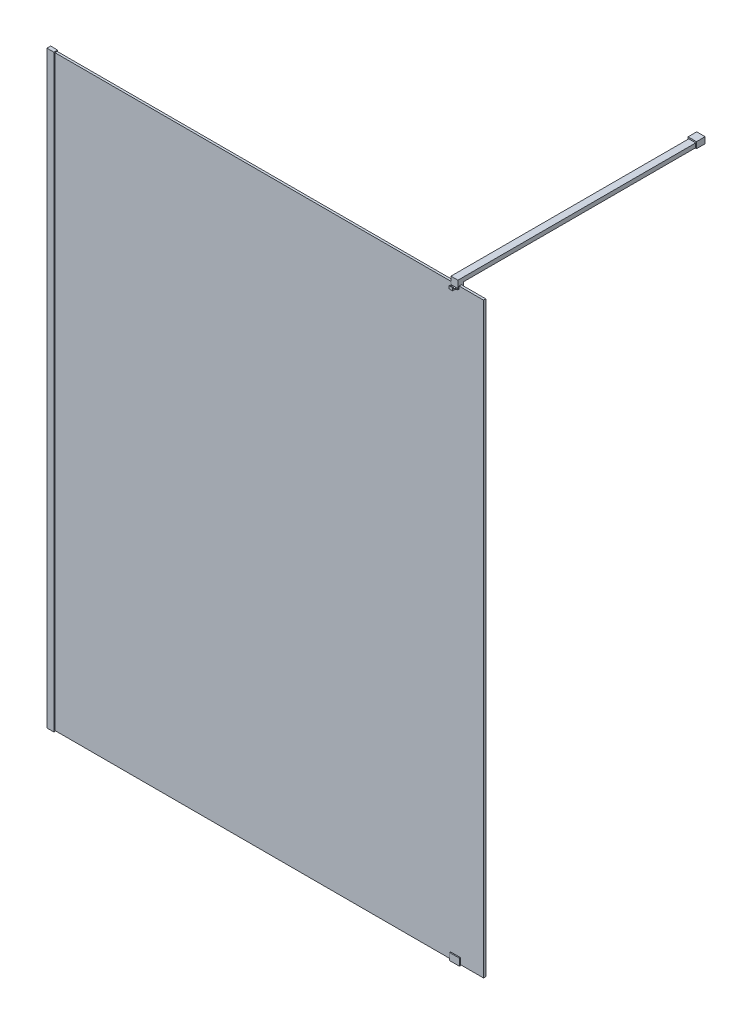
from build123d import *

# Parameters (mm, degrees)
DODANIE_WYCI_GNI_CIE1_DEPTH     = 2100
SZKIC2_W                        = 1547
SZKIC2_H                        = 8
DODANIE_WYCI_GNI_CIE2_DEPTH     = 2100
SZKIC4_W                        = 25
SZKIC4_H                        = 13.3
DODANIE_WYCI_GNI_CIE3_DEPTH     = 3
SZKIC5_W                        = 25
SZKIC5_H                        = 13.3
DODANIE_WYCI_GNI_CIE4_DEPTH     = 3
DODANIE_WYCI_GNI_CIE5_DEPTH     = 17.5
DODANIE_WYCI_GNI_CIE6_DEPTH     = 12.5
WYTNIJ_WYCI_GNI_CIE1_DEPTH      = 2618.585101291
WYTNIJ_WYCI_GNI_CIE1_DEPTH_BACK = 2618.585101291
SZKIC10_W                       = 25
SZKIC10_H                       = 861.63
DODANIE_WYCI_GNI_CIE7_DEPTH     = 15
SZKIC14_W                       = 30
SZKIC14_H                       = 22
DODANIE_WYCI_GNI_CIE8_DEPTH     = 31


with BuildPart() as part:
    # Szkic1 → Dodanie-wyci_gni_cie1 (new body)
    with BuildSketch(Plane(origin=(0, 0, 0), x_dir=(1, 0, 0), z_dir=(0, 1, 0))):
        Polygon((0, 0), (0, 13.3), (25, 13.3), (25, 11.4), (11.45, 11.4), (11.45, 3.4), (25, 3.4), (25, 0), align=None)
    extrude(amount=DODANIE_WYCI_GNI_CIE1_DEPTH)

    # Szkic4 → Dodanie-wyci_gni_cie3 (add)
    with BuildSketch(Plane(origin=(0, 2100, 0), x_dir=(1, 0, 0), z_dir=(0, 1, 0))):
        with Locations((12.5, 6.65)):
            Rectangle(SZKIC4_W, SZKIC4_H)
    extrude(amount=DODANIE_WYCI_GNI_CIE3_DEPTH)

    # Szkic5 → Dodanie-wyci_gni_cie4 (add)
    with BuildSketch(Plane.XZ):
        with Locations((12.5, -6.65)):
            Rectangle(SZKIC5_W, SZKIC5_H)
    extrude(amount=DODANIE_WYCI_GNI_CIE4_DEPTH)


with BuildPart() as body_2:
    # Szkic2 → Dodanie-wyci_gni_cie2 (new body)
    with BuildSketch(Plane.XZ):
        with Locations((784.95, -7.4)):
            Rectangle(SZKIC2_W, SZKIC2_H)
    extrude(amount=-DODANIE_WYCI_GNI_CIE2_DEPTH)


with BuildPart() as body_3:
    # Szkic6 → Dodanie-wyci_gni_cie5 (new, symmetric)
    with BuildSketch(Plane(origin=(1458.45, 0, 0), x_dir=(0, 0, -1), z_dir=(1, 0, 0))):
        Polygon((11.4, 22), (15.75, 22), (15.75, -3), (-0.35, -3), (-0.35, 22), (3.4, 22), (3.4, 0), (11.4, 0), align=None)
    extrude(amount=DODANIE_WYCI_GNI_CIE5_DEPTH, both=True)


with BuildPart() as body_4:
    # Szkic7 → Dodanie-wyci_gni_cie6 (new, symmetric)
    with BuildSketch(Plane(origin=(1458.45, 0, 0), x_dir=(0, 0, -1), z_dir=(1, 0, 0))):
        Polygon((-0.6, 2120), (19.4, 2120), (19.4, 2090), (11.4, 2090), (11.4, 2100), (3.4, 2100), (3.4, 2090), (-13.37, 2090), (-13.37, 2100), (-10.37, 2100), (-9.845068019, 2094), (-0.6, 2094), align=None)
    extrude(amount=DODANIE_WYCI_GNI_CIE6_DEPTH, both=True)

    # Szkic8 → Wytnij-wyci_gni_cie1 (cut, two sides: drawn at the far end of the back side and taken through both)
    with BuildSketch(Plane(origin=(0, 2100, 0), x_dir=(1, 0, 0), z_dir=(0, 1, 0)).offset(-WYTNIJ_WYCI_GNI_CIE1_DEPTH_BACK)):
        Polygon((-1229.626400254, 1247.041765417), (1445.95, -0.6), (1452.45, -3.630999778), (1452.45, -13.37), (1464.45, -13.37), (1464.45, -3.630999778), (1470.95, -0.6), (4146.526400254, 1247.041765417), (4146.526400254, -4657.302075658), (-1229.626400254, -4657.302075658), align=None)
    extrude(amount=WYTNIJ_WYCI_GNI_CIE1_DEPTH + WYTNIJ_WYCI_GNI_CIE1_DEPTH_BACK, mode=Mode.SUBTRACT)

    # Szkic10 → Dodanie-wyci_gni_cie7 (add)
    with BuildSketch(Plane(origin=(0, 2120, 0), x_dir=(1, 0, 0), z_dir=(0, 1, 0))):
        with Locations((1458.45, 450.215)):
            Rectangle(SZKIC10_W, SZKIC10_H)
    extrude(amount=-DODANIE_WYCI_GNI_CIE7_DEPTH)

    # Szkic14 → Dodanie-wyci_gni_cie8 (add)
    with BuildSketch(Plane(origin=(0, 0, -881.03), x_dir=(-1, 0, 0), z_dir=(0, 0, -1))):
        with Locations((-1458.45, 2114)):
            Rectangle(SZKIC14_W, SZKIC14_H)
    extrude(amount=-DODANIE_WYCI_GNI_CIE8_DEPTH)


solid = Compound([part.part, body_2.part, body_3.part, body_4.part])
